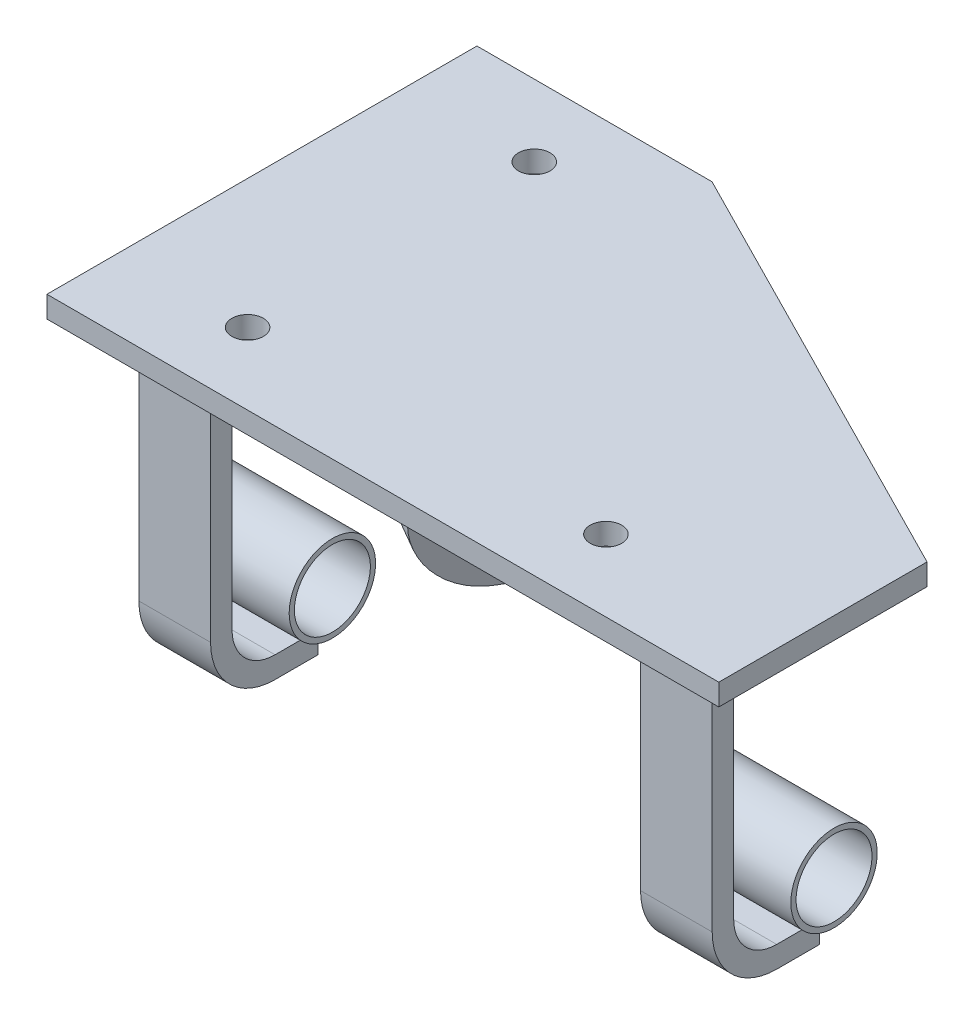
ISO-10303-21;
HEADER;
FILE_DESCRIPTION(('STEP AP214'),'2;1');
FILE_NAME('part.step','',(''),(''),'','','');
FILE_SCHEMA(('AUTOMOTIVE_DESIGN { 1 0 10303 214 1 1 1 1 }'));
ENDSEC;
DATA;
#1=APPLICATION_CONTEXT('core data for automotive mechanical design processes');
#2=APPLICATION_PROTOCOL_DEFINITION('international standard','automotive_design',2000,#1);
#3=PRODUCT_CONTEXT('',#1,'mechanical');
#4=PRODUCT('Part','Part','',(#3));
#5=PRODUCT_RELATED_PRODUCT_CATEGORY('part','',(#4));
#6=PRODUCT_DEFINITION_FORMATION('','',#4);
#7=PRODUCT_DEFINITION_CONTEXT('part definition',#1,'design');
#8=PRODUCT_DEFINITION('design','',#6,#7);
#9=PRODUCT_DEFINITION_SHAPE('','',#8);
#10=(LENGTH_UNIT() NAMED_UNIT(*) SI_UNIT(.MILLI.,.METRE.));
#11=(NAMED_UNIT(*) PLANE_ANGLE_UNIT() SI_UNIT($,.RADIAN.));
#12=(NAMED_UNIT(*) SI_UNIT($,.STERADIAN.) SOLID_ANGLE_UNIT());
#13=UNCERTAINTY_MEASURE_WITH_UNIT(LENGTH_MEASURE(1.E-05),#10,'distance_accuracy_value','');
#14=(GEOMETRIC_REPRESENTATION_CONTEXT(3) GLOBAL_UNCERTAINTY_ASSIGNED_CONTEXT((#13)) GLOBAL_UNIT_ASSIGNED_CONTEXT((#10,
#11,#12)) REPRESENTATION_CONTEXT('',''));
#15=CARTESIAN_POINT('',(0.,0.,0.));
#16=DIRECTION('',(0.,0.,1.));
#17=DIRECTION('',(1.,0.,0.));
#18=AXIS2_PLACEMENT_3D('',#15,#16,#17);
#19=CARTESIAN_POINT('',(21.6435212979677,180.15,-43.2596163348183));
#20=DIRECTION('',(-1.,0.,0.));
#21=DIRECTION('',(0.,0.,1.));
#22=AXIS2_PLACEMENT_3D('',#19,#20,#21);
#23=PLANE('',#22);
#24=DIRECTION('',(0.,0.,-1.));
#25=VECTOR('',#24,1.);
#26=CARTESIAN_POINT('',(21.6435212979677,165.15,-43.2596163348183));
#27=LINE('',#26,#25);
#28=CARTESIAN_POINT('',(21.6435212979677,165.15,102.038173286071));
#29=VERTEX_POINT('',#28);
#30=CARTESIAN_POINT('',(21.6435212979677,165.15,-43.2596163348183));
#31=VERTEX_POINT('',#30);
#32=EDGE_CURVE('E96',#29,#31,#27,.T.);
#33=ORIENTED_EDGE('',*,*,#32,.T.);
#34=DIRECTION('',(0.,-1.,0.));
#35=VECTOR('',#34,1.);
#36=CARTESIAN_POINT('',(21.6435212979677,180.15,-43.2596163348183));
#37=LINE('',#36,#35);
#38=CARTESIAN_POINT('',(21.6435212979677,180.15,-43.2596163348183));
#39=VERTEX_POINT('',#38);
#40=EDGE_CURVE('E12',#39,#31,#37,.T.);
#41=ORIENTED_EDGE('',*,*,#40,.F.);
#42=DIRECTION('',(0.,0.,-1.));
#43=VECTOR('',#42,1.);
#44=CARTESIAN_POINT('',(21.6435212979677,180.15,-43.2596163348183));
#45=LINE('',#44,#43);
#46=CARTESIAN_POINT('',(21.6435212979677,180.15,102.038173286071));
#47=VERTEX_POINT('',#46);
#48=EDGE_CURVE('E122',#47,#39,#45,.T.);
#49=ORIENTED_EDGE('',*,*,#48,.F.);
#50=DIRECTION('',(0.,-1.,0.));
#51=VECTOR('',#50,1.);
#52=CARTESIAN_POINT('',(21.6435212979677,180.15,102.038173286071));
#53=LINE('',#52,#51);
#54=EDGE_CURVE('E109',#47,#29,#53,.T.);
#55=ORIENTED_EDGE('',*,*,#54,.T.);
#56=EDGE_LOOP('',(#33,#41,#49,#55));
#57=FACE_BOUND('',#56,.T.);
#58=ADVANCED_FACE('F46',(#57),#23,.F.);
#59=CARTESIAN_POINT('',(-283.113193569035,180.15,-197.961826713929));
#60=DIRECTION('',(-0.452644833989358,0.,0.891690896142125));
#61=DIRECTION('',(0.891690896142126,0.,0.452644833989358));
#62=AXIS2_PLACEMENT_3D('',#59,#60,#61);
#63=PLANE('',#62);
#64=DIRECTION('',(-0.891690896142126,0.,-0.452644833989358));
#65=VECTOR('',#64,1.);
#66=CARTESIAN_POINT('',(-283.113193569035,165.15,-197.961826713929));
#67=LINE('',#66,#65);
#68=CARTESIAN_POINT('',(-283.113193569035,165.15,-197.961826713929));
#69=VERTEX_POINT('',#68);
#70=EDGE_CURVE('E92',#31,#69,#67,.T.);
#71=ORIENTED_EDGE('',*,*,#70,.T.);
#72=DIRECTION('',(0.,-1.,0.));
#73=VECTOR('',#72,1.);
#74=CARTESIAN_POINT('',(-283.113193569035,180.15,-197.961826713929));
#75=LINE('',#74,#73);
#76=CARTESIAN_POINT('',(-283.113193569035,180.15,-197.961826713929));
#77=VERTEX_POINT('',#76);
#78=EDGE_CURVE('E53',#77,#69,#75,.T.);
#79=ORIENTED_EDGE('',*,*,#78,.F.);
#80=DIRECTION('',(-0.891690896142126,0.,-0.452644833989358));
#81=VECTOR('',#80,1.);
#82=CARTESIAN_POINT('',(-283.113193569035,180.15,-197.961826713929));
#83=LINE('',#82,#81);
#84=EDGE_CURVE('E105',#39,#77,#83,.T.);
#85=ORIENTED_EDGE('',*,*,#84,.F.);
#86=ORIENTED_EDGE('',*,*,#40,.T.);
#87=EDGE_LOOP('',(#71,#79,#85,#86));
#88=FACE_BOUND('',#87,.T.);
#89=ADVANCED_FACE('F104',(#88),#63,.F.);
#90=CARTESIAN_POINT('',(-447.110815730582,180.15,-197.961826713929));
#91=DIRECTION('',(0.,0.,1.));
#92=DIRECTION('',(1.,0.,0.));
#93=AXIS2_PLACEMENT_3D('',#90,#91,#92);
#94=PLANE('',#93);
#95=DIRECTION('',(-1.,0.,0.));
#96=VECTOR('',#95,1.);
#97=CARTESIAN_POINT('',(-447.110815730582,165.15,-197.961826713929));
#98=LINE('',#97,#96);
#99=CARTESIAN_POINT('',(-447.110815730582,165.15,-197.961826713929));
#100=VERTEX_POINT('',#99);
#101=EDGE_CURVE('E98',#69,#100,#98,.T.);
#102=ORIENTED_EDGE('',*,*,#101,.T.);
#103=DIRECTION('',(0.,-1.,0.));
#104=VECTOR('',#103,1.);
#105=CARTESIAN_POINT('',(-447.110815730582,180.15,-197.961826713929));
#106=LINE('',#105,#104);
#107=CARTESIAN_POINT('',(-447.110815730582,180.15,-197.961826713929));
#108=VERTEX_POINT('',#107);
#109=EDGE_CURVE('E133',#108,#100,#106,.T.);
#110=ORIENTED_EDGE('',*,*,#109,.F.);
#111=DIRECTION('',(-1.,0.,0.));
#112=VECTOR('',#111,1.);
#113=CARTESIAN_POINT('',(-447.110815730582,180.15,-197.961826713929));
#114=LINE('',#113,#112);
#115=EDGE_CURVE('E125',#77,#108,#114,.T.);
#116=ORIENTED_EDGE('',*,*,#115,.F.);
#117=ORIENTED_EDGE('',*,*,#78,.T.);
#118=EDGE_LOOP('',(#102,#110,#116,#117));
#119=FACE_BOUND('',#118,.T.);
#120=ADVANCED_FACE('F137',(#119),#94,.F.);
#121=CARTESIAN_POINT('',(-447.110815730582,180.15,102.038173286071));
#122=DIRECTION('',(1.,0.,0.));
#123=DIRECTION('',(0.,0.,-1.));
#124=AXIS2_PLACEMENT_3D('',#121,#122,#123);
#125=PLANE('',#124);
#126=DIRECTION('',(0.,0.,1.));
#127=VECTOR('',#126,1.);
#128=CARTESIAN_POINT('',(-447.110815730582,165.15,102.038173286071));
#129=LINE('',#128,#127);
#130=CARTESIAN_POINT('',(-447.110815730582,165.15,102.038173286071));
#131=VERTEX_POINT('',#130);
#132=EDGE_CURVE('E118',#100,#131,#129,.T.);
#133=ORIENTED_EDGE('',*,*,#132,.T.);
#134=DIRECTION('',(0.,-1.,0.));
#135=VECTOR('',#134,1.);
#136=CARTESIAN_POINT('',(-447.110815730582,180.15,102.038173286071));
#137=LINE('',#136,#135);
#138=CARTESIAN_POINT('',(-447.110815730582,180.15,102.038173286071));
#139=VERTEX_POINT('',#138);
#140=EDGE_CURVE('E130',#139,#131,#137,.T.);
#141=ORIENTED_EDGE('',*,*,#140,.F.);
#142=DIRECTION('',(0.,0.,1.));
#143=VECTOR('',#142,1.);
#144=CARTESIAN_POINT('',(-447.110815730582,180.15,102.038173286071));
#145=LINE('',#144,#143);
#146=EDGE_CURVE('E65',#108,#139,#145,.T.);
#147=ORIENTED_EDGE('',*,*,#146,.F.);
#148=ORIENTED_EDGE('',*,*,#109,.T.);
#149=EDGE_LOOP('',(#133,#141,#147,#148));
#150=FACE_BOUND('',#149,.T.);
#151=ADVANCED_FACE('F152',(#150),#125,.F.);
#152=CARTESIAN_POINT('',(21.6435212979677,180.15,102.038173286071));
#153=DIRECTION('',(0.,0.,-1.));
#154=DIRECTION('',(-1.,0.,0.));
#155=AXIS2_PLACEMENT_3D('',#152,#153,#154);
#156=PLANE('',#155);
#157=DIRECTION('',(1.,0.,0.));
#158=VECTOR('',#157,1.);
#159=CARTESIAN_POINT('',(21.6435212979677,165.15,102.038173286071));
#160=LINE('',#159,#158);
#161=EDGE_CURVE('E120',#131,#29,#160,.T.);
#162=ORIENTED_EDGE('',*,*,#161,.T.);
#163=ORIENTED_EDGE('',*,*,#54,.F.);
#164=DIRECTION('',(1.,0.,0.));
#165=VECTOR('',#164,1.);
#166=CARTESIAN_POINT('',(21.6435212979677,180.15,102.038173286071));
#167=LINE('',#166,#165);
#168=EDGE_CURVE('E60',#139,#47,#167,.T.);
#169=ORIENTED_EDGE('',*,*,#168,.F.);
#170=ORIENTED_EDGE('',*,*,#140,.T.);
#171=EDGE_LOOP('',(#162,#163,#169,#170));
#172=FACE_BOUND('',#171,.T.);
#173=ADVANCED_FACE('F141',(#172),#156,.F.);
#174=CARTESIAN_POINT('',(21.6435212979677,180.15,102.038173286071));
#175=DIRECTION('',(0.,-1.,0.));
#176=DIRECTION('',(0.,0.,-1.));
#177=AXIS2_PLACEMENT_3D('',#174,#175,#176);
#178=PLANE('',#177);
#179=CARTESIAN_POINT('',(-107.110815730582,180.15,52.0381732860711));
#180=DIRECTION('',(0.,1.,0.));
#181=DIRECTION('',(0.,0.,1.));
#182=AXIS2_PLACEMENT_3D('',#179,#180,#181);
#183=CIRCLE('',#182,11.);
#184=CARTESIAN_POINT('',(-107.110815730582,180.15,63.0381732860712));
#185=VERTEX_POINT('',#184);
#186=EDGE_CURVE('E208',#185,#185,#183,.T.);
#187=ORIENTED_EDGE('',*,*,#186,.F.);
#188=EDGE_LOOP('',(#187));
#189=FACE_BOUND('',#188,.T.);
#190=CARTESIAN_POINT('',(-357.110815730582,180.15,52.0381732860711));
#191=DIRECTION('',(0.,1.,0.));
#192=DIRECTION('',(0.,0.,1.));
#193=AXIS2_PLACEMENT_3D('',#190,#191,#192);
#194=CIRCLE('',#193,11.);
#195=CARTESIAN_POINT('',(-357.110815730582,180.15,63.0381732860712));
#196=VERTEX_POINT('',#195);
#197=EDGE_CURVE('E212',#196,#196,#194,.T.);
#198=ORIENTED_EDGE('',*,*,#197,.F.);
#199=EDGE_LOOP('',(#198));
#200=FACE_BOUND('',#199,.T.);
#201=CARTESIAN_POINT('',(-357.110815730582,180.15,-147.961826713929));
#202=DIRECTION('',(0.,1.,0.));
#203=DIRECTION('',(0.,0.,1.));
#204=AXIS2_PLACEMENT_3D('',#201,#202,#203);
#205=CIRCLE('',#204,11.);
#206=CARTESIAN_POINT('',(-357.110815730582,180.15,-136.961826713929));
#207=VERTEX_POINT('',#206);
#208=EDGE_CURVE('E110',#207,#207,#205,.T.);
#209=ORIENTED_EDGE('',*,*,#208,.F.);
#210=EDGE_LOOP('',(#209));
#211=FACE_BOUND('',#210,.T.);
#212=ORIENTED_EDGE('',*,*,#48,.T.);
#213=ORIENTED_EDGE('',*,*,#84,.T.);
#214=ORIENTED_EDGE('',*,*,#115,.T.);
#215=ORIENTED_EDGE('',*,*,#146,.T.);
#216=ORIENTED_EDGE('',*,*,#168,.T.);
#217=EDGE_LOOP('',(#212,#213,#214,#215,#216));
#218=FACE_BOUND('',#217,.T.);
#219=ADVANCED_FACE('F139',(#189,#200,#211,#218),#178,.F.);
#220=CARTESIAN_POINT('',(21.6435212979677,165.15,102.038173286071));
#221=DIRECTION('',(0.,-1.,0.));
#222=DIRECTION('',(0.,0.,-1.));
#223=AXIS2_PLACEMENT_3D('',#220,#221,#222);
#224=PLANE('',#223);
#225=CARTESIAN_POINT('',(-107.110815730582,165.15,52.0381732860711));
#226=DIRECTION('',(0.,-1.,0.));
#227=DIRECTION('',(0.,0.,-1.));
#228=AXIS2_PLACEMENT_3D('',#225,#226,#227);
#229=CIRCLE('',#228,11.);
#230=CARTESIAN_POINT('',(-107.110815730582,165.15,41.0381732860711));
#231=VERTEX_POINT('',#230);
#232=EDGE_CURVE('E206',#231,#231,#229,.F.);
#233=ORIENTED_EDGE('',*,*,#232,.T.);
#234=EDGE_LOOP('',(#233));
#235=FACE_BOUND('',#234,.T.);
#236=CARTESIAN_POINT('',(-357.110815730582,165.15,52.0381732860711));
#237=DIRECTION('',(0.,-1.,0.));
#238=DIRECTION('',(0.,0.,-1.));
#239=AXIS2_PLACEMENT_3D('',#236,#237,#238);
#240=CIRCLE('',#239,11.);
#241=CARTESIAN_POINT('',(-357.110815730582,165.15,41.0381732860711));
#242=VERTEX_POINT('',#241);
#243=EDGE_CURVE('E209',#242,#242,#240,.F.);
#244=ORIENTED_EDGE('',*,*,#243,.T.);
#245=EDGE_LOOP('',(#244));
#246=FACE_BOUND('',#245,.T.);
#247=CARTESIAN_POINT('',(-357.110815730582,165.15,-147.961826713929));
#248=DIRECTION('',(0.,-1.,0.));
#249=DIRECTION('',(0.,0.,-1.));
#250=AXIS2_PLACEMENT_3D('',#247,#248,#249);
#251=CIRCLE('',#250,11.);
#252=CARTESIAN_POINT('',(-357.110815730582,165.15,-158.961826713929));
#253=VERTEX_POINT('',#252);
#254=EDGE_CURVE('E113',#253,#253,#251,.F.);
#255=ORIENTED_EDGE('',*,*,#254,.T.);
#256=EDGE_LOOP('',(#255));
#257=FACE_BOUND('',#256,.T.);
#258=ORIENTED_EDGE('',*,*,#32,.F.);
#259=ORIENTED_EDGE('',*,*,#161,.F.);
#260=ORIENTED_EDGE('',*,*,#132,.F.);
#261=ORIENTED_EDGE('',*,*,#101,.F.);
#262=ORIENTED_EDGE('',*,*,#70,.F.);
#263=EDGE_LOOP('',(#258,#259,#260,#261,#262));
#264=FACE_BOUND('',#263,.T.);
#265=ADVANCED_FACE('F93',(#235,#246,#257,#264),#224,.T.);
#266=CARTESIAN_POINT('',(-357.110815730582,-45.1510000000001,-147.961826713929));
#267=DIRECTION('',(0.,1.,0.));
#268=DIRECTION('',(0.,0.,1.));
#269=AXIS2_PLACEMENT_3D('',#266,#267,#268);
#270=CYLINDRICAL_SURFACE('',#269,11.);
#271=ORIENTED_EDGE('',*,*,#254,.F.);
#272=EDGE_LOOP('',(#271));
#273=FACE_BOUND('',#272,.T.);
#274=ORIENTED_EDGE('',*,*,#208,.T.);
#275=EDGE_LOOP('',(#274));
#276=FACE_BOUND('',#275,.T.);
#277=ADVANCED_FACE('F148',(#273,#276),#270,.F.);
#278=CARTESIAN_POINT('',(-357.110815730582,-45.1510000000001,52.0381732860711));
#279=DIRECTION('',(0.,1.,0.));
#280=DIRECTION('',(0.,0.,1.));
#281=AXIS2_PLACEMENT_3D('',#278,#279,#280);
#282=CYLINDRICAL_SURFACE('',#281,11.);
#283=ORIENTED_EDGE('',*,*,#243,.F.);
#284=EDGE_LOOP('',(#283));
#285=FACE_BOUND('',#284,.T.);
#286=ORIENTED_EDGE('',*,*,#197,.T.);
#287=EDGE_LOOP('',(#286));
#288=FACE_BOUND('',#287,.T.);
#289=ADVANCED_FACE('F180',(#285,#288),#282,.F.);
#290=CARTESIAN_POINT('',(-107.110815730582,-45.1510000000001,52.0381732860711));
#291=DIRECTION('',(0.,1.,0.));
#292=DIRECTION('',(0.,0.,1.));
#293=AXIS2_PLACEMENT_3D('',#290,#291,#292);
#294=CYLINDRICAL_SURFACE('',#293,11.);
#295=ORIENTED_EDGE('',*,*,#232,.F.);
#296=EDGE_LOOP('',(#295));
#297=FACE_BOUND('',#296,.T.);
#298=ORIENTED_EDGE('',*,*,#186,.T.);
#299=EDGE_LOOP('',(#298));
#300=FACE_BOUND('',#299,.T.);
#301=ADVANCED_FACE('F193',(#297,#300),#294,.F.);
#302=CLOSED_SHELL('',(#58,#89,#120,#151,#173,#219,#265,#277,#289,#301));
#303=MANIFOLD_SOLID_BREP('B2',#302);
#304=CARTESIAN_POINT('',(-398.467875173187,-30.1500000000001,-103.038475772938));
#305=DIRECTION('',(0.499999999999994,0.,-0.866025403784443));
#306=DIRECTION('',(-0.866025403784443,0.,-0.499999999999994));
#307=AXIS2_PLACEMENT_3D('',#304,#305,#306);
#308=PLANE('',#307);
#309=DIRECTION('',(0.,1.,0.));
#310=VECTOR('',#309,1.);
#311=CARTESIAN_POINT('',(-355.166604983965,-30.1500000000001,-78.0384757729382));
#312=LINE('',#311,#310);
#313=CARTESIAN_POINT('',(-355.166604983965,-0.150000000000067,-78.0384757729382));
#314=VERTEX_POINT('',#313);
#315=CARTESIAN_POINT('',(-355.166604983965,165.15,-78.0384757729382));
#316=VERTEX_POINT('',#315);
#317=EDGE_CURVE('E310',#314,#316,#312,.T.);
#318=ORIENTED_EDGE('',*,*,#317,.F.);
#319=DIRECTION('',(0.866025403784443,0.,0.499999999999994));
#320=VECTOR('',#319,1.);
#321=CARTESIAN_POINT('',(-398.467875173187,-0.150000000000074,-103.038475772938));
#322=LINE('',#321,#320);
#323=CARTESIAN_POINT('',(-398.467875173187,-0.150000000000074,-103.038475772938));
#324=VERTEX_POINT('',#323);
#325=EDGE_CURVE('E365',#314,#324,#322,.F.);
#326=ORIENTED_EDGE('',*,*,#325,.T.);
#327=DIRECTION('',(0.,1.,0.));
#328=VECTOR('',#327,1.);
#329=CARTESIAN_POINT('',(-398.467875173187,-30.1500000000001,-103.038475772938));
#330=LINE('',#329,#328);
#331=CARTESIAN_POINT('',(-398.467875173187,165.15,-103.038475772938));
#332=VERTEX_POINT('',#331);
#333=EDGE_CURVE('E323',#324,#332,#330,.T.);
#334=ORIENTED_EDGE('',*,*,#333,.T.);
#335=DIRECTION('',(0.866025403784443,0.,0.499999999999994));
#336=VECTOR('',#335,1.);
#337=CARTESIAN_POINT('',(-398.467875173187,165.15,-103.038475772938));
#338=LINE('',#337,#336);
#339=EDGE_CURVE('E321',#332,#316,#338,.T.);
#340=ORIENTED_EDGE('',*,*,#339,.T.);
#341=EDGE_LOOP('',(#318,#326,#334,#340));
#342=FACE_BOUND('',#341,.T.);
#343=ADVANCED_FACE('F249',(#342),#308,.T.);
#344=CARTESIAN_POINT('',(-368.467875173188,-30.15,-155.000000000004));
#345=DIRECTION('',(0.,1.,0.));
#346=DIRECTION('',(0.,0.,1.));
#347=AXIS2_PLACEMENT_3D('',#344,#345,#346);
#348=PLANE('',#347);
#349=DIRECTION('',(-0.499999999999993,0.,0.866025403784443));
#350=VECTOR('',#349,1.);
#351=CARTESIAN_POINT('',(-368.467875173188,-30.15,-155.000000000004));
#352=LINE('',#351,#350);
#353=CARTESIAN_POINT('',(-368.467875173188,-30.15,-155.000000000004));
#354=VERTEX_POINT('',#353);
#355=CARTESIAN_POINT('',(-383.467875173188,-30.1500000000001,-129.019237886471));
#356=VERTEX_POINT('',#355);
#357=EDGE_CURVE('E328',#354,#356,#352,.T.);
#358=ORIENTED_EDGE('',*,*,#357,.T.);
#359=DIRECTION('',(0.866025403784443,0.,0.499999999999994));
#360=VECTOR('',#359,1.);
#361=CARTESIAN_POINT('',(-340.166604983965,-30.1500000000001,-104.019237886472));
#362=LINE('',#361,#360);
#363=CARTESIAN_POINT('',(-340.166604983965,-30.1500000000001,-104.019237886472));
#364=VERTEX_POINT('',#363);
#365=EDGE_CURVE('E358',#356,#364,#362,.T.);
#366=ORIENTED_EDGE('',*,*,#365,.T.);
#367=DIRECTION('',(-0.499999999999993,0.,0.866025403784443));
#368=VECTOR('',#367,1.);
#369=CARTESIAN_POINT('',(-325.166604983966,-30.1500000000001,-130.000000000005));
#370=LINE('',#369,#368);
#371=CARTESIAN_POINT('',(-325.166604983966,-30.1500000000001,-130.000000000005));
#372=VERTEX_POINT('',#371);
#373=EDGE_CURVE('E341',#372,#364,#370,.T.);
#374=ORIENTED_EDGE('',*,*,#373,.F.);
#375=DIRECTION('',(0.866025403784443,0.,0.499999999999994));
#376=VECTOR('',#375,1.);
#377=CARTESIAN_POINT('',(-368.467875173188,-30.15,-155.000000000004));
#378=LINE('',#377,#376);
#379=EDGE_CURVE('E356',#354,#372,#378,.T.);
#380=ORIENTED_EDGE('',*,*,#379,.F.);
#381=EDGE_LOOP('',(#358,#366,#374,#380));
#382=FACE_BOUND('',#381,.T.);
#383=ADVANCED_FACE('F391',(#382),#348,.T.);
#384=CARTESIAN_POINT('',(-368.467875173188,-45.1500000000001,-155.000000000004));
#385=DIRECTION('',(0.499999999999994,0.,-0.866025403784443));
#386=DIRECTION('',(-0.866025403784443,0.,-0.499999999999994));
#387=AXIS2_PLACEMENT_3D('',#384,#385,#386);
#388=PLANE('',#387);
#389=DIRECTION('',(0.,1.,0.));
#390=VECTOR('',#389,1.);
#391=CARTESIAN_POINT('',(-325.166604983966,-45.1500000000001,-130.000000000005));
#392=LINE('',#391,#390);
#393=CARTESIAN_POINT('',(-325.166604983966,-45.1500000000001,-130.000000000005));
#394=VERTEX_POINT('',#393);
#395=EDGE_CURVE('E338',#394,#372,#392,.T.);
#396=ORIENTED_EDGE('',*,*,#395,.F.);
#397=DIRECTION('',(0.866025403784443,0.,0.499999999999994));
#398=VECTOR('',#397,1.);
#399=CARTESIAN_POINT('',(-368.467875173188,-45.1500000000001,-155.000000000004));
#400=LINE('',#399,#398);
#401=CARTESIAN_POINT('',(-368.467875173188,-45.1500000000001,-155.000000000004));
#402=VERTEX_POINT('',#401);
#403=EDGE_CURVE('E359',#402,#394,#400,.T.);
#404=ORIENTED_EDGE('',*,*,#403,.F.);
#405=DIRECTION('',(0.,1.,0.));
#406=VECTOR('',#405,1.);
#407=CARTESIAN_POINT('',(-368.467875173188,-45.1500000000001,-155.000000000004));
#408=LINE('',#407,#406);
#409=EDGE_CURVE('E351',#402,#354,#408,.T.);
#410=ORIENTED_EDGE('',*,*,#409,.T.);
#411=ORIENTED_EDGE('',*,*,#379,.T.);
#412=EDGE_LOOP('',(#396,#404,#410,#411));
#413=FACE_BOUND('',#412,.T.);
#414=ADVANCED_FACE('F388',(#413),#388,.T.);
#415=CARTESIAN_POINT('',(-405.967875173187,-45.1500000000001,-90.0480947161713));
#416=DIRECTION('',(0.,-1.,0.));
#417=DIRECTION('',(0.,0.,-1.));
#418=AXIS2_PLACEMENT_3D('',#415,#416,#417);
#419=PLANE('',#418);
#420=DIRECTION('',(0.499999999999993,0.,-0.866025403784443));
#421=VECTOR('',#420,1.);
#422=CARTESIAN_POINT('',(-362.666604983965,-45.1500000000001,-65.0480947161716));
#423=LINE('',#422,#421);
#424=CARTESIAN_POINT('',(-340.166604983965,-45.1500000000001,-104.019237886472));
#425=VERTEX_POINT('',#424);
#426=EDGE_CURVE('E334',#425,#394,#423,.T.);
#427=ORIENTED_EDGE('',*,*,#426,.F.);
#428=DIRECTION('',(0.866025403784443,0.,0.499999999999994));
#429=VECTOR('',#428,1.);
#430=CARTESIAN_POINT('',(-383.467875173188,-45.1500000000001,-129.019237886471));
#431=LINE('',#430,#429);
#432=CARTESIAN_POINT('',(-383.467875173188,-45.1500000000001,-129.019237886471));
#433=VERTEX_POINT('',#432);
#434=EDGE_CURVE('E256',#425,#433,#431,.F.);
#435=ORIENTED_EDGE('',*,*,#434,.T.);
#436=DIRECTION('',(0.499999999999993,0.,-0.866025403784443));
#437=VECTOR('',#436,1.);
#438=CARTESIAN_POINT('',(-405.967875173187,-45.1500000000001,-90.0480947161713));
#439=LINE('',#438,#437);
#440=EDGE_CURVE('E349',#433,#402,#439,.T.);
#441=ORIENTED_EDGE('',*,*,#440,.T.);
#442=ORIENTED_EDGE('',*,*,#403,.T.);
#443=EDGE_LOOP('',(#427,#435,#441,#442));
#444=FACE_BOUND('',#443,.T.);
#445=ADVANCED_FACE('F385',(#444),#419,.T.);
#446=CARTESIAN_POINT('',(-405.967875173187,165.15,-90.0480947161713));
#447=DIRECTION('',(-0.499999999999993,0.,0.866025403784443));
#448=DIRECTION('',(0.866025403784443,0.,0.499999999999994));
#449=AXIS2_PLACEMENT_3D('',#446,#447,#448);
#450=PLANE('',#449);
#451=DIRECTION('',(0.,-1.,0.));
#452=VECTOR('',#451,1.);
#453=CARTESIAN_POINT('',(-405.967875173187,165.15,-90.0480947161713));
#454=LINE('',#453,#452);
#455=CARTESIAN_POINT('',(-405.967875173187,165.15,-90.0480947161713));
#456=VERTEX_POINT('',#455);
#457=CARTESIAN_POINT('',(-405.967875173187,-0.150000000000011,-90.0480947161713));
#458=VERTEX_POINT('',#457);
#459=EDGE_CURVE('E346',#456,#458,#454,.T.);
#460=ORIENTED_EDGE('',*,*,#459,.T.);
#461=DIRECTION('',(0.866025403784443,0.,0.499999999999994));
#462=VECTOR('',#461,1.);
#463=CARTESIAN_POINT('',(-405.967875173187,-0.150000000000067,-90.0480947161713));
#464=LINE('',#463,#462);
#465=CARTESIAN_POINT('',(-362.666604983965,-0.150000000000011,-65.0480947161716));
#466=VERTEX_POINT('',#465);
#467=EDGE_CURVE('E370',#458,#466,#464,.T.);
#468=ORIENTED_EDGE('',*,*,#467,.T.);
#469=DIRECTION('',(0.,-1.,0.));
#470=VECTOR('',#469,1.);
#471=CARTESIAN_POINT('',(-362.666604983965,165.15,-65.0480947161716));
#472=LINE('',#471,#470);
#473=CARTESIAN_POINT('',(-362.666604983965,165.15,-65.0480947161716));
#474=VERTEX_POINT('',#473);
#475=EDGE_CURVE('E332',#474,#466,#472,.T.);
#476=ORIENTED_EDGE('',*,*,#475,.F.);
#477=DIRECTION('',(0.866025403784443,0.,0.499999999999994));
#478=VECTOR('',#477,1.);
#479=CARTESIAN_POINT('',(-405.967875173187,165.15,-90.0480947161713));
#480=LINE('',#479,#478);
#481=EDGE_CURVE('E327',#456,#474,#480,.T.);
#482=ORIENTED_EDGE('',*,*,#481,.F.);
#483=EDGE_LOOP('',(#460,#468,#476,#482));
#484=FACE_BOUND('',#483,.T.);
#485=ADVANCED_FACE('F375',(#484),#450,.T.);
#486=CARTESIAN_POINT('',(-398.467875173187,165.15,-103.038475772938));
#487=DIRECTION('',(0.,1.,0.));
#488=DIRECTION('',(0.,0.,1.));
#489=AXIS2_PLACEMENT_3D('',#486,#487,#488);
#490=PLANE('',#489);
#491=DIRECTION('',(-0.499999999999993,0.,0.866025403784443));
#492=VECTOR('',#491,1.);
#493=CARTESIAN_POINT('',(-355.166604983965,165.15,-78.0384757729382));
#494=LINE('',#493,#492);
#495=EDGE_CURVE('E314',#316,#474,#494,.T.);
#496=ORIENTED_EDGE('',*,*,#495,.F.);
#497=ORIENTED_EDGE('',*,*,#339,.F.);
#498=DIRECTION('',(-0.499999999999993,0.,0.866025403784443));
#499=VECTOR('',#498,1.);
#500=CARTESIAN_POINT('',(-398.467875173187,165.15,-103.038475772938));
#501=LINE('',#500,#499);
#502=EDGE_CURVE('E344',#332,#456,#501,.T.);
#503=ORIENTED_EDGE('',*,*,#502,.T.);
#504=ORIENTED_EDGE('',*,*,#481,.T.);
#505=EDGE_LOOP('',(#496,#497,#503,#504));
#506=FACE_BOUND('',#505,.T.);
#507=ADVANCED_FACE('F330',(#506),#490,.T.);
#508=CARTESIAN_POINT('',(-398.467875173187,165.15,-103.038475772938));
#509=DIRECTION('',(0.866025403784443,0.,0.499999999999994));
#510=DIRECTION('',(0.499999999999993,0.,-0.866025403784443));
#511=AXIS2_PLACEMENT_3D('',#508,#509,#510);
#512=PLANE('',#511);
#513=ORIENTED_EDGE('',*,*,#440,.F.);
#514=CARTESIAN_POINT('',(-383.467875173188,-0.15000000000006,-129.019237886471));
#515=DIRECTION('',(0.866025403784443,0.,0.499999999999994));
#516=DIRECTION('',(0.499999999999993,0.,-0.866025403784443));
#517=AXIS2_PLACEMENT_3D('',#514,#515,#516);
#518=CIRCLE('',#517,45.);
#519=EDGE_CURVE('E44',#433,#458,#518,.F.);
#520=ORIENTED_EDGE('',*,*,#519,.T.);
#521=ORIENTED_EDGE('',*,*,#459,.F.);
#522=ORIENTED_EDGE('',*,*,#502,.F.);
#523=ORIENTED_EDGE('',*,*,#333,.F.);
#524=CARTESIAN_POINT('',(-383.467875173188,-0.150000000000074,-129.019237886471));
#525=DIRECTION('',(0.866025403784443,0.,0.499999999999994));
#526=DIRECTION('',(0.499999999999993,0.,-0.866025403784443));
#527=AXIS2_PLACEMENT_3D('',#524,#525,#526);
#528=CIRCLE('',#527,30.);
#529=EDGE_CURVE('E368',#324,#356,#528,.T.);
#530=ORIENTED_EDGE('',*,*,#529,.T.);
#531=ORIENTED_EDGE('',*,*,#357,.F.);
#532=ORIENTED_EDGE('',*,*,#409,.F.);
#533=EDGE_LOOP('',(#513,#520,#521,#522,#523,#530,#531,#532));
#534=FACE_BOUND('',#533,.T.);
#535=ADVANCED_FACE('F381',(#534),#512,.F.);
#536=CARTESIAN_POINT('',(-355.166604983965,165.15,-78.0384757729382));
#537=DIRECTION('',(0.866025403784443,0.,0.499999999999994));
#538=DIRECTION('',(0.499999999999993,0.,-0.866025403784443));
#539=AXIS2_PLACEMENT_3D('',#536,#537,#538);
#540=PLANE('',#539);
#541=ORIENTED_EDGE('',*,*,#475,.T.);
#542=CARTESIAN_POINT('',(-340.166604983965,-0.150000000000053,-104.019237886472));
#543=DIRECTION('',(0.866025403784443,0.,0.499999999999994));
#544=DIRECTION('',(0.499999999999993,0.,-0.866025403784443));
#545=AXIS2_PLACEMENT_3D('',#542,#543,#544);
#546=CIRCLE('',#545,45.);
#547=EDGE_CURVE('E270',#466,#425,#546,.T.);
#548=ORIENTED_EDGE('',*,*,#547,.T.);
#549=ORIENTED_EDGE('',*,*,#426,.T.);
#550=ORIENTED_EDGE('',*,*,#395,.T.);
#551=ORIENTED_EDGE('',*,*,#373,.T.);
#552=CARTESIAN_POINT('',(-340.166604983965,-0.15000000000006,-104.019237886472));
#553=DIRECTION('',(0.866025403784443,0.,0.499999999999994));
#554=DIRECTION('',(0.499999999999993,0.,-0.866025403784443));
#555=AXIS2_PLACEMENT_3D('',#552,#553,#554);
#556=CIRCLE('',#555,30.);
#557=EDGE_CURVE('E316',#364,#314,#556,.F.);
#558=ORIENTED_EDGE('',*,*,#557,.T.);
#559=ORIENTED_EDGE('',*,*,#317,.T.);
#560=ORIENTED_EDGE('',*,*,#495,.T.);
#561=EDGE_LOOP('',(#541,#548,#549,#550,#551,#558,#559,#560));
#562=FACE_BOUND('',#561,.T.);
#563=ADVANCED_FACE('F312',(#562),#540,.T.);
#564=CARTESIAN_POINT('',(-383.467875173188,-0.150000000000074,-129.019237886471));
#565=DIRECTION('',(-0.866025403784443,0.,-0.499999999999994));
#566=DIRECTION('',(-0.499999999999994,0.,0.866025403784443));
#567=AXIS2_PLACEMENT_3D('',#564,#565,#566);
#568=CYLINDRICAL_SURFACE('',#567,30.);
#569=ORIENTED_EDGE('',*,*,#529,.F.);
#570=ORIENTED_EDGE('',*,*,#325,.F.);
#571=ORIENTED_EDGE('',*,*,#557,.F.);
#572=ORIENTED_EDGE('',*,*,#365,.F.);
#573=EDGE_LOOP('',(#569,#570,#571,#572));
#574=FACE_BOUND('',#573,.T.);
#575=ADVANCED_FACE('F395',(#574),#568,.F.);
#576=CARTESIAN_POINT('',(-383.467875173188,-0.15000000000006,-129.019237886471));
#577=DIRECTION('',(0.866025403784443,0.,0.499999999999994));
#578=DIRECTION('',(0.499999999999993,0.,-0.866025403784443));
#579=AXIS2_PLACEMENT_3D('',#576,#577,#578);
#580=CYLINDRICAL_SURFACE('',#579,45.);
#581=ORIENTED_EDGE('',*,*,#519,.F.);
#582=ORIENTED_EDGE('',*,*,#434,.F.);
#583=ORIENTED_EDGE('',*,*,#547,.F.);
#584=ORIENTED_EDGE('',*,*,#467,.F.);
#585=EDGE_LOOP('',(#581,#582,#583,#584));
#586=FACE_BOUND('',#585,.T.);
#587=ADVANCED_FACE('F379',(#586),#580,.T.);
#588=CLOSED_SHELL('',(#343,#383,#414,#445,#485,#507,#535,#563,#575,#587));
#589=MANIFOLD_SOLID_BREP('B6',#588);
#590=CARTESIAN_POINT('',(-410.000000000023,-45.15,1.11022302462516E-13));
#591=DIRECTION('',(0.,0.,-1.));
#592=DIRECTION('',(-1.,0.,0.));
#593=AXIS2_PLACEMENT_3D('',#590,#591,#592);
#594=PLANE('',#593);
#595=DIRECTION('',(0.,1.,0.));
#596=VECTOR('',#595,1.);
#597=CARTESIAN_POINT('',(-360.000000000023,-45.15,0.));
#598=LINE('',#597,#596);
#599=CARTESIAN_POINT('',(-360.000000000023,-45.15,0.));
#600=VERTEX_POINT('',#599);
#601=CARTESIAN_POINT('',(-360.000000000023,-30.15,0.));
#602=VERTEX_POINT('',#601);
#603=EDGE_CURVE('E513',#600,#602,#598,.T.);
#604=ORIENTED_EDGE('',*,*,#603,.F.);
#605=DIRECTION('',(1.,0.,0.));
#606=VECTOR('',#605,1.);
#607=CARTESIAN_POINT('',(-410.000000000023,-45.15,1.11022302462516E-13));
#608=LINE('',#607,#606);
#609=CARTESIAN_POINT('',(-410.000000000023,-45.15,1.11022302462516E-13));
#610=VERTEX_POINT('',#609);
#611=EDGE_CURVE('E554',#610,#600,#608,.T.);
#612=ORIENTED_EDGE('',*,*,#611,.F.);
#613=DIRECTION('',(0.,1.,0.));
#614=VECTOR('',#613,1.);
#615=CARTESIAN_POINT('',(-410.000000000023,-45.15,1.11022302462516E-13));
#616=LINE('',#615,#614);
#617=CARTESIAN_POINT('',(-410.000000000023,-30.15,0.));
#618=VERTEX_POINT('',#617);
#619=EDGE_CURVE('E515',#610,#618,#616,.T.);
#620=ORIENTED_EDGE('',*,*,#619,.T.);
#621=DIRECTION('',(1.,0.,0.));
#622=VECTOR('',#621,1.);
#623=CARTESIAN_POINT('',(-410.000000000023,-30.15,0.));
#624=LINE('',#623,#622);
#625=EDGE_CURVE('E509',#618,#602,#624,.T.);
#626=ORIENTED_EDGE('',*,*,#625,.T.);
#627=EDGE_LOOP('',(#604,#612,#620,#626));
#628=FACE_BOUND('',#627,.T.);
#629=ADVANCED_FACE('F447',(#628),#594,.T.);
#630=CARTESIAN_POINT('',(-410.000000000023,-45.15,75.0000000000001));
#631=DIRECTION('',(0.,-1.,0.));
#632=DIRECTION('',(0.,0.,-1.));
#633=AXIS2_PLACEMENT_3D('',#630,#631,#632);
#634=PLANE('',#633);
#635=DIRECTION('',(0.,0.,-1.));
#636=VECTOR('',#635,1.);
#637=CARTESIAN_POINT('',(-360.000000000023,-45.15,75.));
#638=LINE('',#637,#636);
#639=CARTESIAN_POINT('',(-360.000000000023,-45.15,30.0000000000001));
#640=VERTEX_POINT('',#639);
#641=EDGE_CURVE('E531',#640,#600,#638,.T.);
#642=ORIENTED_EDGE('',*,*,#641,.F.);
#643=DIRECTION('',(1.,0.,0.));
#644=VECTOR('',#643,1.);
#645=CARTESIAN_POINT('',(-410.000000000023,-45.15,30.0000000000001));
#646=LINE('',#645,#644);
#647=CARTESIAN_POINT('',(-410.000000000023,-45.15,30.0000000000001));
#648=VERTEX_POINT('',#647);
#649=EDGE_CURVE('E454',#640,#648,#646,.F.);
#650=ORIENTED_EDGE('',*,*,#649,.T.);
#651=DIRECTION('',(0.,0.,-1.));
#652=VECTOR('',#651,1.);
#653=CARTESIAN_POINT('',(-410.000000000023,-45.15,75.0000000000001));
#654=LINE('',#653,#652);
#655=EDGE_CURVE('E520',#648,#610,#654,.T.);
#656=ORIENTED_EDGE('',*,*,#655,.T.);
#657=ORIENTED_EDGE('',*,*,#611,.T.);
#658=EDGE_LOOP('',(#642,#650,#656,#657));
#659=FACE_BOUND('',#658,.T.);
#660=ADVANCED_FACE('F596',(#659),#634,.T.);
#661=CARTESIAN_POINT('',(-410.000000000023,165.15,75.0000000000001));
#662=DIRECTION('',(0.,0.,1.));
#663=DIRECTION('',(0.,-1.,0.));
#664=AXIS2_PLACEMENT_3D('',#661,#662,#663);
#665=PLANE('',#664);
#666=DIRECTION('',(0.,-1.,0.));
#667=VECTOR('',#666,1.);
#668=CARTESIAN_POINT('',(-410.000000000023,165.15,75.0000000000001));
#669=LINE('',#668,#667);
#670=CARTESIAN_POINT('',(-410.000000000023,165.15,75.0000000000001));
#671=VERTEX_POINT('',#670);
#672=CARTESIAN_POINT('',(-410.000000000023,-0.149999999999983,75.0000000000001));
#673=VERTEX_POINT('',#672);
#674=EDGE_CURVE('E550',#671,#673,#669,.T.);
#675=ORIENTED_EDGE('',*,*,#674,.T.);
#676=DIRECTION('',(1.,0.,0.));
#677=VECTOR('',#676,1.);
#678=CARTESIAN_POINT('',(-410.000000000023,-0.149999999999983,75.0000000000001));
#679=LINE('',#678,#677);
#680=CARTESIAN_POINT('',(-360.000000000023,-0.149999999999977,75.0000000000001));
#681=VERTEX_POINT('',#680);
#682=EDGE_CURVE('E567',#673,#681,#679,.T.);
#683=ORIENTED_EDGE('',*,*,#682,.T.);
#684=DIRECTION('',(0.,-1.,0.));
#685=VECTOR('',#684,1.);
#686=CARTESIAN_POINT('',(-360.000000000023,165.15,75.0000000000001));
#687=LINE('',#686,#685);
#688=CARTESIAN_POINT('',(-360.000000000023,165.15,75.0000000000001));
#689=VERTEX_POINT('',#688);
#690=EDGE_CURVE('E539',#689,#681,#687,.T.);
#691=ORIENTED_EDGE('',*,*,#690,.F.);
#692=DIRECTION('',(1.,0.,0.));
#693=VECTOR('',#692,1.);
#694=CARTESIAN_POINT('',(-410.000000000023,165.15,75.0000000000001));
#695=LINE('',#694,#693);
#696=EDGE_CURVE('E556',#671,#689,#695,.T.);
#697=ORIENTED_EDGE('',*,*,#696,.F.);
#698=EDGE_LOOP('',(#675,#683,#691,#697));
#699=FACE_BOUND('',#698,.T.);
#700=ADVANCED_FACE('F573',(#699),#665,.T.);
#701=CARTESIAN_POINT('',(-410.000000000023,165.15,60.0000000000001));
#702=DIRECTION('',(0.,1.,0.));
#703=DIRECTION('',(0.,0.,1.));
#704=AXIS2_PLACEMENT_3D('',#701,#702,#703);
#705=PLANE('',#704);
#706=DIRECTION('',(0.,0.,1.));
#707=VECTOR('',#706,1.);
#708=CARTESIAN_POINT('',(-360.000000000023,165.15,60.0000000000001));
#709=LINE('',#708,#707);
#710=CARTESIAN_POINT('',(-360.000000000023,165.15,60.0000000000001));
#711=VERTEX_POINT('',#710);
#712=EDGE_CURVE('E536',#711,#689,#709,.T.);
#713=ORIENTED_EDGE('',*,*,#712,.F.);
#714=DIRECTION('',(1.,0.,0.));
#715=VECTOR('',#714,1.);
#716=CARTESIAN_POINT('',(-410.000000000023,165.15,60.0000000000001));
#717=LINE('',#716,#715);
#718=CARTESIAN_POINT('',(-410.000000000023,165.15,60.0000000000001));
#719=VERTEX_POINT('',#718);
#720=EDGE_CURVE('E519',#719,#711,#717,.T.);
#721=ORIENTED_EDGE('',*,*,#720,.F.);
#722=DIRECTION('',(0.,0.,1.));
#723=VECTOR('',#722,1.);
#724=CARTESIAN_POINT('',(-410.000000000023,165.15,60.0000000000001));
#725=LINE('',#724,#723);
#726=EDGE_CURVE('E547',#719,#671,#725,.T.);
#727=ORIENTED_EDGE('',*,*,#726,.T.);
#728=ORIENTED_EDGE('',*,*,#696,.T.);
#729=EDGE_LOOP('',(#713,#721,#727,#728));
#730=FACE_BOUND('',#729,.T.);
#731=ADVANCED_FACE('F581',(#730),#705,.T.);
#732=CARTESIAN_POINT('',(-410.000000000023,-30.15,60.0000000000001));
#733=DIRECTION('',(0.,0.,-1.));
#734=DIRECTION('',(-1.,0.,0.));
#735=AXIS2_PLACEMENT_3D('',#732,#733,#734);
#736=PLANE('',#735);
#737=DIRECTION('',(0.,1.,0.));
#738=VECTOR('',#737,1.);
#739=CARTESIAN_POINT('',(-360.000000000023,-30.15,60.0000000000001));
#740=LINE('',#739,#738);
#741=CARTESIAN_POINT('',(-360.000000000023,-0.150000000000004,60.0000000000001));
#742=VERTEX_POINT('',#741);
#743=EDGE_CURVE('E528',#742,#711,#740,.T.);
#744=ORIENTED_EDGE('',*,*,#743,.F.);
#745=DIRECTION('',(1.,0.,0.));
#746=VECTOR('',#745,1.);
#747=CARTESIAN_POINT('',(-410.000000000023,-0.149999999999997,60.0000000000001));
#748=LINE('',#747,#746);
#749=CARTESIAN_POINT('',(-410.000000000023,-0.149999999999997,60.0000000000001));
#750=VERTEX_POINT('',#749);
#751=EDGE_CURVE('E561',#742,#750,#748,.F.);
#752=ORIENTED_EDGE('',*,*,#751,.T.);
#753=DIRECTION('',(0.,1.,0.));
#754=VECTOR('',#753,1.);
#755=CARTESIAN_POINT('',(-410.000000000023,-30.15,60.0000000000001));
#756=LINE('',#755,#754);
#757=EDGE_CURVE('E545',#750,#719,#756,.T.);
#758=ORIENTED_EDGE('',*,*,#757,.T.);
#759=ORIENTED_EDGE('',*,*,#720,.T.);
#760=EDGE_LOOP('',(#744,#752,#758,#759));
#761=FACE_BOUND('',#760,.T.);
#762=ADVANCED_FACE('F610',(#761),#736,.T.);
#763=CARTESIAN_POINT('',(-410.000000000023,-30.15,0.));
#764=DIRECTION('',(0.,1.,0.));
#765=DIRECTION('',(0.,0.,1.));
#766=AXIS2_PLACEMENT_3D('',#763,#764,#765);
#767=PLANE('',#766);
#768=DIRECTION('',(0.,0.,1.));
#769=VECTOR('',#768,1.);
#770=CARTESIAN_POINT('',(-410.000000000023,-30.15,0.));
#771=LINE('',#770,#769);
#772=CARTESIAN_POINT('',(-410.000000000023,-30.15,30.0000000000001));
#773=VERTEX_POINT('',#772);
#774=EDGE_CURVE('E543',#618,#773,#771,.T.);
#775=ORIENTED_EDGE('',*,*,#774,.T.);
#776=DIRECTION('',(1.,0.,0.));
#777=VECTOR('',#776,1.);
#778=CARTESIAN_POINT('',(-360.000000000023,-30.15,30.0000000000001));
#779=LINE('',#778,#777);
#780=CARTESIAN_POINT('',(-360.000000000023,-30.15,30.0000000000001));
#781=VERTEX_POINT('',#780);
#782=EDGE_CURVE('E527',#773,#781,#779,.T.);
#783=ORIENTED_EDGE('',*,*,#782,.T.);
#784=DIRECTION('',(0.,0.,1.));
#785=VECTOR('',#784,1.);
#786=CARTESIAN_POINT('',(-360.000000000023,-30.15,0.));
#787=LINE('',#786,#785);
#788=EDGE_CURVE('E524',#602,#781,#787,.T.);
#789=ORIENTED_EDGE('',*,*,#788,.F.);
#790=ORIENTED_EDGE('',*,*,#625,.F.);
#791=EDGE_LOOP('',(#775,#783,#789,#790));
#792=FACE_BOUND('',#791,.T.);
#793=ADVANCED_FACE('F525',(#792),#767,.T.);
#794=CARTESIAN_POINT('',(-410.000000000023,-30.15,0.));
#795=DIRECTION('',(1.,0.,0.));
#796=DIRECTION('',(0.,0.,-1.));
#797=AXIS2_PLACEMENT_3D('',#794,#795,#796);
#798=PLANE('',#797);
#799=ORIENTED_EDGE('',*,*,#655,.F.);
#800=CARTESIAN_POINT('',(-410.000000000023,-0.149999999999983,30.0000000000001));
#801=DIRECTION('',(1.,0.,0.));
#802=DIRECTION('',(0.,0.,-1.));
#803=AXIS2_PLACEMENT_3D('',#800,#801,#802);
#804=CIRCLE('',#803,45.);
#805=EDGE_CURVE('E247',#648,#673,#804,.F.);
#806=ORIENTED_EDGE('',*,*,#805,.T.);
#807=ORIENTED_EDGE('',*,*,#674,.F.);
#808=ORIENTED_EDGE('',*,*,#726,.F.);
#809=ORIENTED_EDGE('',*,*,#757,.F.);
#810=CARTESIAN_POINT('',(-410.000000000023,-0.14999999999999,30.0000000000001));
#811=DIRECTION('',(1.,0.,0.));
#812=DIRECTION('',(0.,0.,-1.));
#813=AXIS2_PLACEMENT_3D('',#810,#811,#812);
#814=CIRCLE('',#813,30.);
#815=EDGE_CURVE('E565',#750,#773,#814,.T.);
#816=ORIENTED_EDGE('',*,*,#815,.T.);
#817=ORIENTED_EDGE('',*,*,#774,.F.);
#818=ORIENTED_EDGE('',*,*,#619,.F.);
#819=EDGE_LOOP('',(#799,#806,#807,#808,#809,#816,#817,#818));
#820=FACE_BOUND('',#819,.T.);
#821=ADVANCED_FACE('F584',(#820),#798,.F.);
#822=CARTESIAN_POINT('',(-360.000000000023,-30.15,0.));
#823=DIRECTION('',(1.,0.,0.));
#824=DIRECTION('',(0.,0.,-1.));
#825=AXIS2_PLACEMENT_3D('',#822,#823,#824);
#826=PLANE('',#825);
#827=ORIENTED_EDGE('',*,*,#690,.T.);
#828=CARTESIAN_POINT('',(-360.000000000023,-0.14999999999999,30.));
#829=DIRECTION('',(1.,0.,0.));
#830=DIRECTION('',(0.,0.,-1.));
#831=AXIS2_PLACEMENT_3D('',#828,#829,#830);
#832=CIRCLE('',#831,45.);
#833=EDGE_CURVE('E468',#681,#640,#832,.T.);
#834=ORIENTED_EDGE('',*,*,#833,.T.);
#835=ORIENTED_EDGE('',*,*,#641,.T.);
#836=ORIENTED_EDGE('',*,*,#603,.T.);
#837=ORIENTED_EDGE('',*,*,#788,.T.);
#838=CARTESIAN_POINT('',(-360.000000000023,-0.150000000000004,30.0000000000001));
#839=DIRECTION('',(1.,0.,0.));
#840=DIRECTION('',(0.,0.,-1.));
#841=AXIS2_PLACEMENT_3D('',#838,#839,#840);
#842=CIRCLE('',#841,30.);
#843=EDGE_CURVE('E563',#781,#742,#842,.F.);
#844=ORIENTED_EDGE('',*,*,#843,.T.);
#845=ORIENTED_EDGE('',*,*,#743,.T.);
#846=ORIENTED_EDGE('',*,*,#712,.T.);
#847=EDGE_LOOP('',(#827,#834,#835,#836,#837,#844,#845,#846));
#848=FACE_BOUND('',#847,.T.);
#849=ADVANCED_FACE('F530',(#848),#826,.T.);
#850=CARTESIAN_POINT('',(-410.000000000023,-0.14999999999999,30.0000000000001));
#851=DIRECTION('',(-1.,0.,0.));
#852=DIRECTION('',(0.,0.,1.));
#853=AXIS2_PLACEMENT_3D('',#850,#851,#852);
#854=CYLINDRICAL_SURFACE('',#853,30.);
#855=ORIENTED_EDGE('',*,*,#815,.F.);
#856=ORIENTED_EDGE('',*,*,#751,.F.);
#857=ORIENTED_EDGE('',*,*,#843,.F.);
#858=ORIENTED_EDGE('',*,*,#782,.F.);
#859=EDGE_LOOP('',(#855,#856,#857,#858));
#860=FACE_BOUND('',#859,.T.);
#861=ADVANCED_FACE('F588',(#860),#854,.F.);
#862=CARTESIAN_POINT('',(-410.000000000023,-0.149999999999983,30.0000000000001));
#863=DIRECTION('',(1.,0.,0.));
#864=DIRECTION('',(0.,0.,-1.));
#865=AXIS2_PLACEMENT_3D('',#862,#863,#864);
#866=CYLINDRICAL_SURFACE('',#865,45.);
#867=ORIENTED_EDGE('',*,*,#805,.F.);
#868=ORIENTED_EDGE('',*,*,#649,.F.);
#869=ORIENTED_EDGE('',*,*,#833,.F.);
#870=ORIENTED_EDGE('',*,*,#682,.F.);
#871=EDGE_LOOP('',(#867,#868,#869,#870));
#872=FACE_BOUND('',#871,.T.);
#873=ADVANCED_FACE('F586',(#872),#866,.T.);
#874=CLOSED_SHELL('',(#629,#660,#700,#731,#762,#793,#821,#849,#861,#873));
#875=MANIFOLD_SOLID_BREP('B38',#874);
#876=CARTESIAN_POINT('',(-60.,-45.15,0.));
#877=DIRECTION('',(0.,0.,-1.));
#878=DIRECTION('',(-1.,0.,0.));
#879=AXIS2_PLACEMENT_3D('',#876,#877,#878);
#880=PLANE('',#879);
#881=DIRECTION('',(0.,1.,0.));
#882=VECTOR('',#881,1.);
#883=CARTESIAN_POINT('',(-10.,-45.1500000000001,0.));
#884=LINE('',#883,#882);
#885=CARTESIAN_POINT('',(-10.,-45.1500000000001,0.));
#886=VERTEX_POINT('',#885);
#887=CARTESIAN_POINT('',(-10.,-30.15,0.));
#888=VERTEX_POINT('',#887);
#889=EDGE_CURVE('E709',#886,#888,#884,.T.);
#890=ORIENTED_EDGE('',*,*,#889,.F.);
#891=DIRECTION('',(1.,0.,0.));
#892=VECTOR('',#891,1.);
#893=CARTESIAN_POINT('',(-60.,-45.15,0.));
#894=LINE('',#893,#892);
#895=CARTESIAN_POINT('',(-60.,-45.15,0.));
#896=VERTEX_POINT('',#895);
#897=EDGE_CURVE('E750',#896,#886,#894,.T.);
#898=ORIENTED_EDGE('',*,*,#897,.F.);
#899=DIRECTION('',(0.,1.,0.));
#900=VECTOR('',#899,1.);
#901=CARTESIAN_POINT('',(-60.,-45.15,0.));
#902=LINE('',#901,#900);
#903=CARTESIAN_POINT('',(-60.,-30.15,0.));
#904=VERTEX_POINT('',#903);
#905=EDGE_CURVE('E711',#896,#904,#902,.T.);
#906=ORIENTED_EDGE('',*,*,#905,.T.);
#907=DIRECTION('',(1.,0.,0.));
#908=VECTOR('',#907,1.);
#909=CARTESIAN_POINT('',(-60.,-30.15,0.));
#910=LINE('',#909,#908);
#911=EDGE_CURVE('E705',#904,#888,#910,.T.);
#912=ORIENTED_EDGE('',*,*,#911,.T.);
#913=EDGE_LOOP('',(#890,#898,#906,#912));
#914=FACE_BOUND('',#913,.T.);
#915=ADVANCED_FACE('F643',(#914),#880,.T.);
#916=CARTESIAN_POINT('',(-60.,-45.15,75.));
#917=DIRECTION('',(0.,-1.,0.));
#918=DIRECTION('',(0.,0.,-1.));
#919=AXIS2_PLACEMENT_3D('',#916,#917,#918);
#920=PLANE('',#919);
#921=DIRECTION('',(0.,0.,-1.));
#922=VECTOR('',#921,1.);
#923=CARTESIAN_POINT('',(-9.99999999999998,-45.15,75.));
#924=LINE('',#923,#922);
#925=CARTESIAN_POINT('',(-9.99999999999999,-45.1500000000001,30.));
#926=VERTEX_POINT('',#925);
#927=EDGE_CURVE('E727',#926,#886,#924,.T.);
#928=ORIENTED_EDGE('',*,*,#927,.F.);
#929=DIRECTION('',(1.,0.,0.));
#930=VECTOR('',#929,1.);
#931=CARTESIAN_POINT('',(-60.,-45.15,30.));
#932=LINE('',#931,#930);
#933=CARTESIAN_POINT('',(-60.,-45.15,30.));
#934=VERTEX_POINT('',#933);
#935=EDGE_CURVE('E650',#926,#934,#932,.F.);
#936=ORIENTED_EDGE('',*,*,#935,.T.);
#937=DIRECTION('',(0.,0.,-1.));
#938=VECTOR('',#937,1.);
#939=CARTESIAN_POINT('',(-60.,-45.15,75.));
#940=LINE('',#939,#938);
#941=EDGE_CURVE('E716',#934,#896,#940,.T.);
#942=ORIENTED_EDGE('',*,*,#941,.T.);
#943=ORIENTED_EDGE('',*,*,#897,.T.);
#944=EDGE_LOOP('',(#928,#936,#942,#943));
#945=FACE_BOUND('',#944,.T.);
#946=ADVANCED_FACE('F792',(#945),#920,.T.);
#947=CARTESIAN_POINT('',(-60.,165.15,75.));
#948=DIRECTION('',(0.,0.,1.));
#949=DIRECTION('',(1.,0.,0.));
#950=AXIS2_PLACEMENT_3D('',#947,#948,#949);
#951=PLANE('',#950);
#952=DIRECTION('',(0.,-1.,0.));
#953=VECTOR('',#952,1.);
#954=CARTESIAN_POINT('',(-60.,165.15,75.));
#955=LINE('',#954,#953);
#956=CARTESIAN_POINT('',(-60.,165.15,75.));
#957=VERTEX_POINT('',#956);
#958=CARTESIAN_POINT('',(-60.,-0.150000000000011,75.));
#959=VERTEX_POINT('',#958);
#960=EDGE_CURVE('E746',#957,#959,#955,.T.);
#961=ORIENTED_EDGE('',*,*,#960,.T.);
#962=DIRECTION('',(1.,0.,0.));
#963=VECTOR('',#962,1.);
#964=CARTESIAN_POINT('',(-60.,-0.150000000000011,75.));
#965=LINE('',#964,#963);
#966=CARTESIAN_POINT('',(-9.99999999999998,-0.150000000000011,75.));
#967=VERTEX_POINT('',#966);
#968=EDGE_CURVE('E763',#959,#967,#965,.T.);
#969=ORIENTED_EDGE('',*,*,#968,.T.);
#970=DIRECTION('',(0.,-1.,0.));
#971=VECTOR('',#970,1.);
#972=CARTESIAN_POINT('',(-9.99999999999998,165.15,75.));
#973=LINE('',#972,#971);
#974=CARTESIAN_POINT('',(-9.99999999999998,165.15,75.));
#975=VERTEX_POINT('',#974);
#976=EDGE_CURVE('E735',#975,#967,#973,.T.);
#977=ORIENTED_EDGE('',*,*,#976,.F.);
#978=DIRECTION('',(1.,0.,0.));
#979=VECTOR('',#978,1.);
#980=CARTESIAN_POINT('',(-60.,165.15,75.));
#981=LINE('',#980,#979);
#982=EDGE_CURVE('E752',#957,#975,#981,.T.);
#983=ORIENTED_EDGE('',*,*,#982,.F.);
#984=EDGE_LOOP('',(#961,#969,#977,#983));
#985=FACE_BOUND('',#984,.T.);
#986=ADVANCED_FACE('F769',(#985),#951,.T.);
#987=CARTESIAN_POINT('',(-60.,165.15,60.));
#988=DIRECTION('',(0.,1.,0.));
#989=DIRECTION('',(0.,0.,1.));
#990=AXIS2_PLACEMENT_3D('',#987,#988,#989);
#991=PLANE('',#990);
#992=DIRECTION('',(0.,0.,1.));
#993=VECTOR('',#992,1.);
#994=CARTESIAN_POINT('',(-9.99999999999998,165.15,60.));
#995=LINE('',#994,#993);
#996=CARTESIAN_POINT('',(-9.99999999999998,165.15,60.));
#997=VERTEX_POINT('',#996);
#998=EDGE_CURVE('E732',#997,#975,#995,.T.);
#999=ORIENTED_EDGE('',*,*,#998,.F.);
#1000=DIRECTION('',(1.,0.,0.));
#1001=VECTOR('',#1000,1.);
#1002=CARTESIAN_POINT('',(-60.,165.15,60.));
#1003=LINE('',#1002,#1001);
#1004=CARTESIAN_POINT('',(-60.,165.15,60.));
#1005=VERTEX_POINT('',#1004);
#1006=EDGE_CURVE('E715',#1005,#997,#1003,.T.);
#1007=ORIENTED_EDGE('',*,*,#1006,.F.);
#1008=DIRECTION('',(0.,0.,1.));
#1009=VECTOR('',#1008,1.);
#1010=CARTESIAN_POINT('',(-60.,165.15,60.));
#1011=LINE('',#1010,#1009);
#1012=EDGE_CURVE('E743',#1005,#957,#1011,.T.);
#1013=ORIENTED_EDGE('',*,*,#1012,.T.);
#1014=ORIENTED_EDGE('',*,*,#982,.T.);
#1015=EDGE_LOOP('',(#999,#1007,#1013,#1014));
#1016=FACE_BOUND('',#1015,.T.);
#1017=ADVANCED_FACE('F777',(#1016),#991,.T.);
#1018=CARTESIAN_POINT('',(-60.,-30.15,60.));
#1019=DIRECTION('',(0.,0.,-1.));
#1020=DIRECTION('',(-1.,0.,0.));
#1021=AXIS2_PLACEMENT_3D('',#1018,#1019,#1020);
#1022=PLANE('',#1021);
#1023=DIRECTION('',(0.,1.,0.));
#1024=VECTOR('',#1023,1.);
#1025=CARTESIAN_POINT('',(-9.99999999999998,-30.15,60.));
#1026=LINE('',#1025,#1024);
#1027=CARTESIAN_POINT('',(-9.99999999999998,-0.150000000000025,60.));
#1028=VERTEX_POINT('',#1027);
#1029=EDGE_CURVE('E724',#1028,#997,#1026,.T.);
#1030=ORIENTED_EDGE('',*,*,#1029,.F.);
#1031=DIRECTION('',(1.,0.,0.));
#1032=VECTOR('',#1031,1.);
#1033=CARTESIAN_POINT('',(-60.,-0.150000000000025,60.));
#1034=LINE('',#1033,#1032);
#1035=CARTESIAN_POINT('',(-60.,-0.150000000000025,60.));
#1036=VERTEX_POINT('',#1035);
#1037=EDGE_CURVE('E757',#1028,#1036,#1034,.F.);
#1038=ORIENTED_EDGE('',*,*,#1037,.T.);
#1039=DIRECTION('',(0.,1.,0.));
#1040=VECTOR('',#1039,1.);
#1041=CARTESIAN_POINT('',(-60.,-30.15,60.));
#1042=LINE('',#1041,#1040);
#1043=EDGE_CURVE('E741',#1036,#1005,#1042,.T.);
#1044=ORIENTED_EDGE('',*,*,#1043,.T.);
#1045=ORIENTED_EDGE('',*,*,#1006,.T.);
#1046=EDGE_LOOP('',(#1030,#1038,#1044,#1045));
#1047=FACE_BOUND('',#1046,.T.);
#1048=ADVANCED_FACE('F806',(#1047),#1022,.T.);
#1049=CARTESIAN_POINT('',(-60.,-30.15,0.));
#1050=DIRECTION('',(0.,1.,0.));
#1051=DIRECTION('',(0.,0.,1.));
#1052=AXIS2_PLACEMENT_3D('',#1049,#1050,#1051);
#1053=PLANE('',#1052);
#1054=DIRECTION('',(0.,0.,1.));
#1055=VECTOR('',#1054,1.);
#1056=CARTESIAN_POINT('',(-60.,-30.15,0.));
#1057=LINE('',#1056,#1055);
#1058=CARTESIAN_POINT('',(-60.,-30.15,30.));
#1059=VERTEX_POINT('',#1058);
#1060=EDGE_CURVE('E739',#904,#1059,#1057,.T.);
#1061=ORIENTED_EDGE('',*,*,#1060,.T.);
#1062=DIRECTION('',(1.,0.,0.));
#1063=VECTOR('',#1062,1.);
#1064=CARTESIAN_POINT('',(-9.99999999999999,-30.15,30.));
#1065=LINE('',#1064,#1063);
#1066=CARTESIAN_POINT('',(-9.99999999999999,-30.15,30.));
#1067=VERTEX_POINT('',#1066);
#1068=EDGE_CURVE('E723',#1059,#1067,#1065,.T.);
#1069=ORIENTED_EDGE('',*,*,#1068,.T.);
#1070=DIRECTION('',(0.,0.,1.));
#1071=VECTOR('',#1070,1.);
#1072=CARTESIAN_POINT('',(-10.,-30.15,0.));
#1073=LINE('',#1072,#1071);
#1074=EDGE_CURVE('E720',#888,#1067,#1073,.T.);
#1075=ORIENTED_EDGE('',*,*,#1074,.F.);
#1076=ORIENTED_EDGE('',*,*,#911,.F.);
#1077=EDGE_LOOP('',(#1061,#1069,#1075,#1076));
#1078=FACE_BOUND('',#1077,.T.);
#1079=ADVANCED_FACE('F721',(#1078),#1053,.T.);
#1080=CARTESIAN_POINT('',(-60.,165.15,0.));
#1081=DIRECTION('',(1.,0.,0.));
#1082=DIRECTION('',(0.,0.,-1.));
#1083=AXIS2_PLACEMENT_3D('',#1080,#1081,#1082);
#1084=PLANE('',#1083);
#1085=ORIENTED_EDGE('',*,*,#941,.F.);
#1086=CARTESIAN_POINT('',(-60.,-0.150000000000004,30.));
#1087=DIRECTION('',(1.,0.,0.));
#1088=DIRECTION('',(0.,0.,-1.));
#1089=AXIS2_PLACEMENT_3D('',#1086,#1087,#1088);
#1090=CIRCLE('',#1089,45.);
#1091=EDGE_CURVE('E445',#934,#959,#1090,.F.);
#1092=ORIENTED_EDGE('',*,*,#1091,.T.);
#1093=ORIENTED_EDGE('',*,*,#960,.F.);
#1094=ORIENTED_EDGE('',*,*,#1012,.F.);
#1095=ORIENTED_EDGE('',*,*,#1043,.F.);
#1096=CARTESIAN_POINT('',(-60.,-0.150000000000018,30.));
#1097=DIRECTION('',(1.,0.,0.));
#1098=DIRECTION('',(0.,0.,-1.));
#1099=AXIS2_PLACEMENT_3D('',#1096,#1097,#1098);
#1100=CIRCLE('',#1099,30.);
#1101=EDGE_CURVE('E761',#1036,#1059,#1100,.T.);
#1102=ORIENTED_EDGE('',*,*,#1101,.T.);
#1103=ORIENTED_EDGE('',*,*,#1060,.F.);
#1104=ORIENTED_EDGE('',*,*,#905,.F.);
#1105=EDGE_LOOP('',(#1085,#1092,#1093,#1094,#1095,#1102,#1103,#1104));
#1106=FACE_BOUND('',#1105,.T.);
#1107=ADVANCED_FACE('F780',(#1106),#1084,.F.);
#1108=CARTESIAN_POINT('',(-9.99999999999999,165.15,0.));
#1109=DIRECTION('',(1.,0.,0.));
#1110=DIRECTION('',(0.,0.,-1.));
#1111=AXIS2_PLACEMENT_3D('',#1108,#1109,#1110);
#1112=PLANE('',#1111);
#1113=ORIENTED_EDGE('',*,*,#976,.T.);
#1114=CARTESIAN_POINT('',(-9.99999999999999,-0.150000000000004,30.));
#1115=DIRECTION('',(1.,0.,0.));
#1116=DIRECTION('',(0.,0.,-1.));
#1117=AXIS2_PLACEMENT_3D('',#1114,#1115,#1116);
#1118=CIRCLE('',#1117,45.);
#1119=EDGE_CURVE('E664',#967,#926,#1118,.T.);
#1120=ORIENTED_EDGE('',*,*,#1119,.T.);
#1121=ORIENTED_EDGE('',*,*,#927,.T.);
#1122=ORIENTED_EDGE('',*,*,#889,.T.);
#1123=ORIENTED_EDGE('',*,*,#1074,.T.);
#1124=CARTESIAN_POINT('',(-9.99999999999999,-0.150000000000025,30.));
#1125=DIRECTION('',(1.,0.,0.));
#1126=DIRECTION('',(0.,0.,-1.));
#1127=AXIS2_PLACEMENT_3D('',#1124,#1125,#1126);
#1128=CIRCLE('',#1127,30.);
#1129=EDGE_CURVE('E759',#1067,#1028,#1128,.F.);
#1130=ORIENTED_EDGE('',*,*,#1129,.T.);
#1131=ORIENTED_EDGE('',*,*,#1029,.T.);
#1132=ORIENTED_EDGE('',*,*,#998,.T.);
#1133=EDGE_LOOP('',(#1113,#1120,#1121,#1122,#1123,#1130,#1131,#1132));
#1134=FACE_BOUND('',#1133,.T.);
#1135=ADVANCED_FACE('F726',(#1134),#1112,.T.);
#1136=CARTESIAN_POINT('',(-60.,-0.150000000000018,30.));
#1137=DIRECTION('',(-1.,0.,0.));
#1138=DIRECTION('',(0.,0.,1.));
#1139=AXIS2_PLACEMENT_3D('',#1136,#1137,#1138);
#1140=CYLINDRICAL_SURFACE('',#1139,30.);
#1141=ORIENTED_EDGE('',*,*,#1101,.F.);
#1142=ORIENTED_EDGE('',*,*,#1037,.F.);
#1143=ORIENTED_EDGE('',*,*,#1129,.F.);
#1144=ORIENTED_EDGE('',*,*,#1068,.F.);
#1145=EDGE_LOOP('',(#1141,#1142,#1143,#1144));
#1146=FACE_BOUND('',#1145,.T.);
#1147=ADVANCED_FACE('F784',(#1146),#1140,.F.);
#1148=CARTESIAN_POINT('',(-60.,-0.150000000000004,30.));
#1149=DIRECTION('',(1.,0.,0.));
#1150=DIRECTION('',(0.,0.,-1.));
#1151=AXIS2_PLACEMENT_3D('',#1148,#1149,#1150);
#1152=CYLINDRICAL_SURFACE('',#1151,45.);
#1153=ORIENTED_EDGE('',*,*,#1091,.F.);
#1154=ORIENTED_EDGE('',*,*,#935,.F.);
#1155=ORIENTED_EDGE('',*,*,#1119,.F.);
#1156=ORIENTED_EDGE('',*,*,#968,.F.);
#1157=EDGE_LOOP('',(#1153,#1154,#1155,#1156));
#1158=FACE_BOUND('',#1157,.T.);
#1159=ADVANCED_FACE('F782',(#1158),#1152,.T.);
#1160=CLOSED_SHELL('',(#915,#946,#986,#1017,#1048,#1079,#1107,#1135,#1147,#1159));
#1161=MANIFOLD_SOLID_BREP('B241',#1160);
#1162=CARTESIAN_POINT('',(-316.50635094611,0.,-124.999999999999));
#1163=DIRECTION('',(-0.866025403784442,0.,-0.499999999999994));
#1164=DIRECTION('',(-0.499999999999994,0.,0.866025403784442));
#1165=AXIS2_PLACEMENT_3D('',#1162,#1163,#1164);
#1166=CYLINDRICAL_SURFACE('',#1165,26.5);
#1167=CARTESIAN_POINT('',(-316.50635094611,0.,-124.999999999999));
#1168=DIRECTION('',(0.866025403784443,0.,0.499999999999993));
#1169=DIRECTION('',(0.499999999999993,0.,-0.866025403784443));
#1170=AXIS2_PLACEMENT_3D('',#1167,#1168,#1169);
#1171=CIRCLE('',#1170,26.5);
#1172=CARTESIAN_POINT('',(-303.256350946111,0.,-147.949673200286));
#1173=VERTEX_POINT('',#1172);
#1174=EDGE_CURVE('E845',#1173,#1173,#1171,.T.);
#1175=ORIENTED_EDGE('',*,*,#1174,.T.);
#1176=EDGE_LOOP('',(#1175));
#1177=FACE_BOUND('',#1176,.T.);
#1178=CARTESIAN_POINT('',(-403.108891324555,0.,-174.999999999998));
#1179=DIRECTION('',(0.866025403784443,0.,0.499999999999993));
#1180=DIRECTION('',(0.499999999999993,0.,-0.866025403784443));
#1181=AXIS2_PLACEMENT_3D('',#1178,#1179,#1180);
#1182=CIRCLE('',#1181,26.5);
#1183=CARTESIAN_POINT('',(-389.858891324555,0.,-197.949673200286));
#1184=VERTEX_POINT('',#1183);
#1185=EDGE_CURVE('E853',#1184,#1184,#1182,.T.);
#1186=ORIENTED_EDGE('',*,*,#1185,.F.);
#1187=EDGE_LOOP('',(#1186));
#1188=FACE_BOUND('',#1187,.T.);
#1189=ADVANCED_FACE('F839',(#1177,#1188),#1166,.F.);
#1190=CARTESIAN_POINT('',(-316.50635094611,0.,-124.999999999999));
#1191=DIRECTION('',(-0.866025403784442,0.,-0.499999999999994));
#1192=DIRECTION('',(-0.499999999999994,0.,0.866025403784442));
#1193=AXIS2_PLACEMENT_3D('',#1190,#1191,#1192);
#1194=CYLINDRICAL_SURFACE('',#1193,30.15);
#1195=CARTESIAN_POINT('',(-316.50635094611,0.,-124.999999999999));
#1196=DIRECTION('',(0.866025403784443,0.,0.499999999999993));
#1197=DIRECTION('',(0.499999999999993,0.,-0.866025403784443));
#1198=AXIS2_PLACEMENT_3D('',#1195,#1196,#1197);
#1199=CIRCLE('',#1198,30.15);
#1200=CARTESIAN_POINT('',(-301.431350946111,0.,-151.1106659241));
#1201=VERTEX_POINT('',#1200);
#1202=EDGE_CURVE('E642',#1201,#1201,#1199,.T.);
#1203=ORIENTED_EDGE('',*,*,#1202,.F.);
#1204=EDGE_LOOP('',(#1203));
#1205=FACE_BOUND('',#1204,.T.);
#1206=CARTESIAN_POINT('',(-403.108891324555,0.,-174.999999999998));
#1207=DIRECTION('',(0.866025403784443,0.,0.499999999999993));
#1208=DIRECTION('',(0.499999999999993,0.,-0.866025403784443));
#1209=AXIS2_PLACEMENT_3D('',#1206,#1207,#1208);
#1210=CIRCLE('',#1209,30.15);
#1211=CARTESIAN_POINT('',(-388.033891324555,0.,-201.110665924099));
#1212=VERTEX_POINT('',#1211);
#1213=EDGE_CURVE('E849',#1212,#1212,#1210,.T.);
#1214=ORIENTED_EDGE('',*,*,#1213,.T.);
#1215=EDGE_LOOP('',(#1214));
#1216=FACE_BOUND('',#1215,.T.);
#1217=ADVANCED_FACE('F863',(#1205,#1216),#1194,.T.);
#1218=CARTESIAN_POINT('',(-316.50635094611,0.,-124.999999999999));
#1219=DIRECTION('',(0.866025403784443,0.,0.499999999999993));
#1220=DIRECTION('',(0.499999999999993,0.,-0.866025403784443));
#1221=AXIS2_PLACEMENT_3D('',#1218,#1219,#1220);
#1222=PLANE('',#1221);
#1223=ORIENTED_EDGE('',*,*,#1174,.F.);
#1224=EDGE_LOOP('',(#1223));
#1225=FACE_BOUND('',#1224,.T.);
#1226=ORIENTED_EDGE('',*,*,#1202,.T.);
#1227=EDGE_LOOP('',(#1226));
#1228=FACE_BOUND('',#1227,.T.);
#1229=ADVANCED_FACE('F868',(#1225,#1228),#1222,.T.);
#1230=CARTESIAN_POINT('',(-403.108891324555,0.,-174.999999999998));
#1231=DIRECTION('',(0.866025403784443,0.,0.499999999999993));
#1232=DIRECTION('',(0.499999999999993,0.,-0.866025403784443));
#1233=AXIS2_PLACEMENT_3D('',#1230,#1231,#1232);
#1234=PLANE('',#1233);
#1235=ORIENTED_EDGE('',*,*,#1185,.T.);
#1236=EDGE_LOOP('',(#1235));
#1237=FACE_BOUND('',#1236,.T.);
#1238=ORIENTED_EDGE('',*,*,#1213,.F.);
#1239=EDGE_LOOP('',(#1238));
#1240=FACE_BOUND('',#1239,.T.);
#1241=ADVANCED_FACE('F859',(#1237,#1240),#1234,.F.);
#1242=CLOSED_SHELL('',(#1189,#1217,#1229,#1241));
#1243=MANIFOLD_SOLID_BREP('B439',#1242);
#1244=CARTESIAN_POINT('',(-100.,0.,0.));
#1245=DIRECTION('',(1.,0.,0.));
#1246=DIRECTION('',(0.,0.,-1.));
#1247=AXIS2_PLACEMENT_3D('',#1244,#1245,#1246);
#1248=CYLINDRICAL_SURFACE('',#1247,26.5);
#1249=CARTESIAN_POINT('',(-100.,0.,0.));
#1250=DIRECTION('',(-1.,0.,0.));
#1251=DIRECTION('',(0.,0.,1.));
#1252=AXIS2_PLACEMENT_3D('',#1249,#1250,#1251);
#1253=CIRCLE('',#1252,26.5);
#1254=CARTESIAN_POINT('',(-100.,0.,26.5));
#1255=VERTEX_POINT('',#1254);
#1256=EDGE_CURVE('E906',#1255,#1255,#1253,.T.);
#1257=ORIENTED_EDGE('',*,*,#1256,.T.);
#1258=EDGE_LOOP('',(#1257));
#1259=FACE_BOUND('',#1258,.T.);
#1260=CARTESIAN_POINT('',(0.,0.,0.));
#1261=DIRECTION('',(-1.,0.,0.));
#1262=DIRECTION('',(0.,0.,1.));
#1263=AXIS2_PLACEMENT_3D('',#1260,#1261,#1262);
#1264=CIRCLE('',#1263,26.5);
#1265=CARTESIAN_POINT('',(0.,0.,26.5));
#1266=VERTEX_POINT('',#1265);
#1267=EDGE_CURVE('E914',#1266,#1266,#1264,.T.);
#1268=ORIENTED_EDGE('',*,*,#1267,.F.);
#1269=EDGE_LOOP('',(#1268));
#1270=FACE_BOUND('',#1269,.T.);
#1271=ADVANCED_FACE('F900',(#1259,#1270),#1248,.F.);
#1272=CARTESIAN_POINT('',(-100.,0.,0.));
#1273=DIRECTION('',(1.,0.,0.));
#1274=DIRECTION('',(0.,0.,-1.));
#1275=AXIS2_PLACEMENT_3D('',#1272,#1273,#1274);
#1276=CYLINDRICAL_SURFACE('',#1275,30.15);
#1277=CARTESIAN_POINT('',(-100.,0.,0.));
#1278=DIRECTION('',(-1.,0.,0.));
#1279=DIRECTION('',(0.,0.,1.));
#1280=AXIS2_PLACEMENT_3D('',#1277,#1278,#1279);
#1281=CIRCLE('',#1280,30.15);
#1282=CARTESIAN_POINT('',(-100.,0.,30.15));
#1283=VERTEX_POINT('',#1282);
#1284=EDGE_CURVE('E838',#1283,#1283,#1281,.T.);
#1285=ORIENTED_EDGE('',*,*,#1284,.F.);
#1286=EDGE_LOOP('',(#1285));
#1287=FACE_BOUND('',#1286,.T.);
#1288=CARTESIAN_POINT('',(0.,0.,0.));
#1289=DIRECTION('',(-1.,0.,0.));
#1290=DIRECTION('',(0.,0.,1.));
#1291=AXIS2_PLACEMENT_3D('',#1288,#1289,#1290);
#1292=CIRCLE('',#1291,30.15);
#1293=CARTESIAN_POINT('',(0.,0.,30.15));
#1294=VERTEX_POINT('',#1293);
#1295=EDGE_CURVE('E910',#1294,#1294,#1292,.T.);
#1296=ORIENTED_EDGE('',*,*,#1295,.T.);
#1297=EDGE_LOOP('',(#1296));
#1298=FACE_BOUND('',#1297,.T.);
#1299=ADVANCED_FACE('F924',(#1287,#1298),#1276,.T.);
#1300=CARTESIAN_POINT('',(-100.,0.,0.));
#1301=DIRECTION('',(-1.,0.,0.));
#1302=DIRECTION('',(0.,0.,1.));
#1303=AXIS2_PLACEMENT_3D('',#1300,#1301,#1302);
#1304=PLANE('',#1303);
#1305=ORIENTED_EDGE('',*,*,#1256,.F.);
#1306=EDGE_LOOP('',(#1305));
#1307=FACE_BOUND('',#1306,.T.);
#1308=ORIENTED_EDGE('',*,*,#1284,.T.);
#1309=EDGE_LOOP('',(#1308));
#1310=FACE_BOUND('',#1309,.T.);
#1311=ADVANCED_FACE('F929',(#1307,#1310),#1304,.T.);
#1312=CARTESIAN_POINT('',(0.,0.,0.));
#1313=DIRECTION('',(-1.,0.,0.));
#1314=DIRECTION('',(0.,0.,1.));
#1315=AXIS2_PLACEMENT_3D('',#1312,#1313,#1314);
#1316=PLANE('',#1315);
#1317=ORIENTED_EDGE('',*,*,#1267,.T.);
#1318=EDGE_LOOP('',(#1317));
#1319=FACE_BOUND('',#1318,.T.);
#1320=ORIENTED_EDGE('',*,*,#1295,.F.);
#1321=EDGE_LOOP('',(#1320));
#1322=FACE_BOUND('',#1321,.T.);
#1323=ADVANCED_FACE('F920',(#1319,#1322),#1316,.F.);
#1324=CLOSED_SHELL('',(#1271,#1299,#1311,#1323));
#1325=MANIFOLD_SOLID_BREP('B637',#1324);
#1326=CARTESIAN_POINT('',(-450.,0.,0.));
#1327=DIRECTION('',(1.,0.,0.));
#1328=DIRECTION('',(0.,0.,-1.));
#1329=AXIS2_PLACEMENT_3D('',#1326,#1327,#1328);
#1330=CYLINDRICAL_SURFACE('',#1329,26.5);
#1331=CARTESIAN_POINT('',(-450.,0.,0.));
#1332=DIRECTION('',(-1.,0.,0.));
#1333=DIRECTION('',(0.,0.,1.));
#1334=AXIS2_PLACEMENT_3D('',#1331,#1332,#1333);
#1335=CIRCLE('',#1334,26.5);
#1336=CARTESIAN_POINT('',(-450.,0.,26.5));
#1337=VERTEX_POINT('',#1336);
#1338=EDGE_CURVE('E960',#1337,#1337,#1335,.T.);
#1339=ORIENTED_EDGE('',*,*,#1338,.T.);
#1340=EDGE_LOOP('',(#1339));
#1341=FACE_BOUND('',#1340,.T.);
#1342=CARTESIAN_POINT('',(-350.,0.,0.));
#1343=DIRECTION('',(-1.,0.,0.));
#1344=DIRECTION('',(0.,0.,1.));
#1345=AXIS2_PLACEMENT_3D('',#1342,#1343,#1344);
#1346=CIRCLE('',#1345,26.5);
#1347=CARTESIAN_POINT('',(-350.,0.,26.5));
#1348=VERTEX_POINT('',#1347);
#1349=EDGE_CURVE('E968',#1348,#1348,#1346,.T.);
#1350=ORIENTED_EDGE('',*,*,#1349,.F.);
#1351=EDGE_LOOP('',(#1350));
#1352=FACE_BOUND('',#1351,.T.);
#1353=ADVANCED_FACE('F954',(#1341,#1352),#1330,.F.);
#1354=CARTESIAN_POINT('',(-450.,0.,0.));
#1355=DIRECTION('',(1.,0.,0.));
#1356=DIRECTION('',(0.,0.,-1.));
#1357=AXIS2_PLACEMENT_3D('',#1354,#1355,#1356);
#1358=CYLINDRICAL_SURFACE('',#1357,30.15);
#1359=CARTESIAN_POINT('',(-450.,0.,0.));
#1360=DIRECTION('',(-1.,0.,0.));
#1361=DIRECTION('',(0.,0.,1.));
#1362=AXIS2_PLACEMENT_3D('',#1359,#1360,#1361);
#1363=CIRCLE('',#1362,30.15);
#1364=CARTESIAN_POINT('',(-450.,0.,30.15));
#1365=VERTEX_POINT('',#1364);
#1366=EDGE_CURVE('E899',#1365,#1365,#1363,.T.);
#1367=ORIENTED_EDGE('',*,*,#1366,.F.);
#1368=EDGE_LOOP('',(#1367));
#1369=FACE_BOUND('',#1368,.T.);
#1370=CARTESIAN_POINT('',(-350.,0.,0.));
#1371=DIRECTION('',(-1.,0.,0.));
#1372=DIRECTION('',(0.,0.,1.));
#1373=AXIS2_PLACEMENT_3D('',#1370,#1371,#1372);
#1374=CIRCLE('',#1373,30.15);
#1375=CARTESIAN_POINT('',(-350.,0.,30.15));
#1376=VERTEX_POINT('',#1375);
#1377=EDGE_CURVE('E964',#1376,#1376,#1374,.T.);
#1378=ORIENTED_EDGE('',*,*,#1377,.T.);
#1379=EDGE_LOOP('',(#1378));
#1380=FACE_BOUND('',#1379,.T.);
#1381=ADVANCED_FACE('F978',(#1369,#1380),#1358,.T.);
#1382=CARTESIAN_POINT('',(-450.,0.,0.));
#1383=DIRECTION('',(-1.,0.,0.));
#1384=DIRECTION('',(0.,0.,1.));
#1385=AXIS2_PLACEMENT_3D('',#1382,#1383,#1384);
#1386=PLANE('',#1385);
#1387=ORIENTED_EDGE('',*,*,#1338,.F.);
#1388=EDGE_LOOP('',(#1387));
#1389=FACE_BOUND('',#1388,.T.);
#1390=ORIENTED_EDGE('',*,*,#1366,.T.);
#1391=EDGE_LOOP('',(#1390));
#1392=FACE_BOUND('',#1391,.T.);
#1393=ADVANCED_FACE('F983',(#1389,#1392),#1386,.T.);
#1394=CARTESIAN_POINT('',(-350.,0.,0.));
#1395=DIRECTION('',(-1.,0.,0.));
#1396=DIRECTION('',(0.,0.,1.));
#1397=AXIS2_PLACEMENT_3D('',#1394,#1395,#1396);
#1398=PLANE('',#1397);
#1399=ORIENTED_EDGE('',*,*,#1349,.T.);
#1400=EDGE_LOOP('',(#1399));
#1401=FACE_BOUND('',#1400,.T.);
#1402=ORIENTED_EDGE('',*,*,#1377,.F.);
#1403=EDGE_LOOP('',(#1402));
#1404=FACE_BOUND('',#1403,.T.);
#1405=ADVANCED_FACE('F974',(#1401,#1404),#1398,.F.);
#1406=CLOSED_SHELL('',(#1353,#1381,#1393,#1405));
#1407=MANIFOLD_SOLID_BREP('B833',#1406);
#1408=ADVANCED_BREP_SHAPE_REPRESENTATION('',(#18,#303,#589,#875,#1161,#1243,#1325,#1407),#14);
#1409=SHAPE_DEFINITION_REPRESENTATION(#9,#1408);
ENDSEC;
END-ISO-10303-21;
